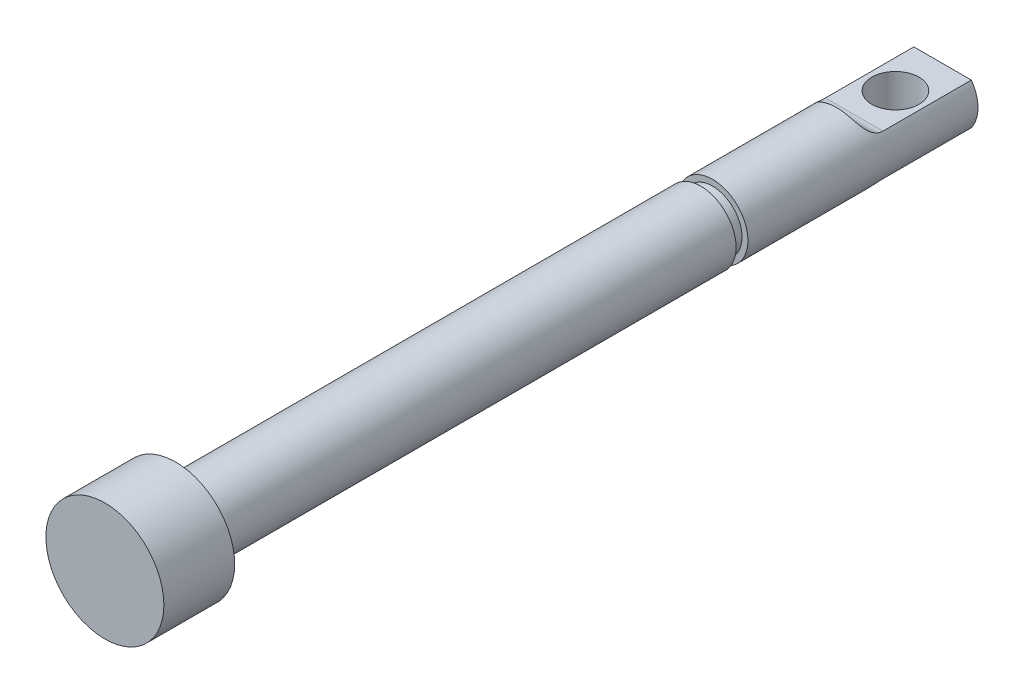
from build123d import *

# Parameters (mm, degrees)
ESQUISSE1_R                  = 6
BASE_EXTRUSION_DEPTH         = 65
ENL_V_MAT_EXTRU_1_DEPTH      = 66.551506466
ENL_V_MAT_EXTRU_1_DEPTH_BACK = 66.551506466
ESQUISSE4_R                  = 4
ESQUISSE5_R                  = 10
BOSS_EXTRU_2_DEPTH           = 12
ESQUISSE7_W                  = 2
ESQUISSE7_H                  = 3.29810605
ENL_V_MAT_EXTRU_2_DEPTH      = 79.287930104
ENL_V_MAT_EXTRU_2_DEPTH_BACK = 79.287930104


with BuildPart() as part:
    # Esquisse1 → Base-Extrusion (new, symmetric)
    with BuildSketch(Plane.XY):
        Circle(ESQUISSE1_R)
    extrude(amount=BASE_EXTRUSION_DEPTH, both=True)

    # Esquisse4 → Enl_v. mat.-Extru.1 (cut, two sides: drawn at the far end of the back side and taken through both)
    with BuildSketch(Plane(origin=(0, 0, 0), x_dir=(1, 0, 0), z_dir=(0, 1, 0)).offset(-ENL_V_MAT_EXTRU_1_DEPTH_BACK)):
        with Locations(Location((0, 57, 0), (0, 0, 270))):
            Circle(ESQUISSE4_R)
    extrude(amount=ENL_V_MAT_EXTRU_1_DEPTH + ENL_V_MAT_EXTRU_1_DEPTH_BACK, mode=Mode.SUBTRACT)

    # Esquisse5 → Boss.-Extru.2 (add)
    with BuildSketch(Plane.XY.offset(65)):
        Circle(ESQUISSE5_R)
    extrude(amount=BOSS_EXTRU_2_DEPTH)

    # Esquisse7 → Enl_vement de mati_re-R_volution1 (revolve, cut)
    with BuildSketch(Plane(origin=(0, 0, 0), x_dir=(0, 0, -1), z_dir=(1, 0, 0)), mode=Mode.PRIVATE) as enl_vement_de_mati_re_r_volution1_sk:
        with Locations((25, 6.649053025)):
            Rectangle(ESQUISSE7_W, ESQUISSE7_H)
    revolve(enl_vement_de_mati_re_r_volution1_sk.sketch.rotate(Axis((0, 0, -45.42087295), (0, 0, 1)), 90), axis=Axis((0, 0, -45.42087295), (0, 0, 1)), mode=Mode.SUBTRACT)

    # Esquisse8 → Enl_v. mat.-Extru.2 (cut, two sides: drawn at the far end of the back side and taken through both)
    with BuildSketch(Plane(origin=(0, 0, 0), x_dir=(0, 0, -1), z_dir=(1, 0, 0)).offset(-ENL_V_MAT_EXTRU_2_DEPTH_BACK)):
        with BuildLine():
            Line((72.298291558, 19.317433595), (47, 19.317433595))
            Line((47, 19.317433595), (47, 6.5))
            ThreePointArc((47, 6.5), (47.878679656, 4.378679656), (50, 3.5))
            Line((50, 3.5), (72.298291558, 3.5))
            Line((72.298291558, 3.5), (72.298291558, 19.317433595))
        make_face()
        with BuildLine():
            Line((47, -24.213305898), (84.296795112, -24.213305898))
            Line((84.296795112, -24.213305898), (84.296795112, -3.5))
            Line((84.296795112, -3.5), (50, -3.5))
            ThreePointArc((50, -3.5), (47.878679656, -4.378679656), (47, -6.5))
            Line((47, -6.5), (47, -24.213305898))
        make_face()
    extrude(amount=ENL_V_MAT_EXTRU_2_DEPTH + ENL_V_MAT_EXTRU_2_DEPTH_BACK, mode=Mode.SUBTRACT)


solid = part.part
